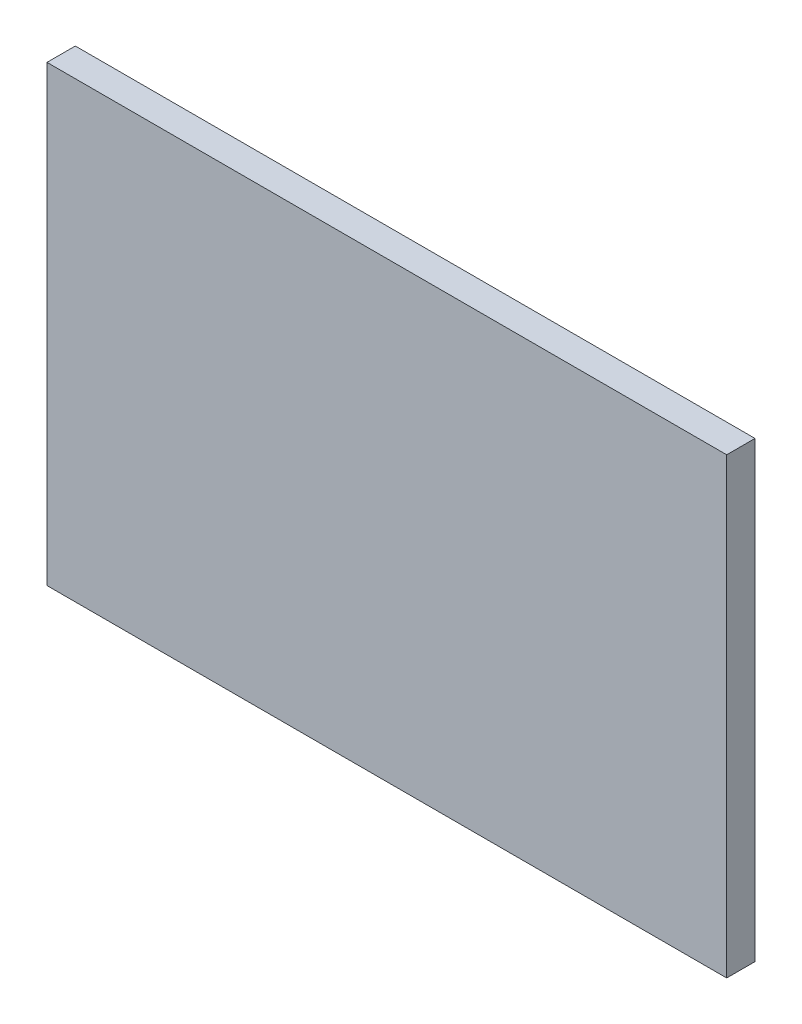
from build123d import *

# Parameters (mm, degrees)
SKETCH1_W      = 76.2
SKETCH1_H      = 50.8
EXTRUDE1_DEPTH = 3.175


with BuildPart() as part:
    # Sketch1 → Extrude1 (new body)
    with BuildSketch(Plane.XY):
        with Locations((-38.1, -25.4)):
            Rectangle(SKETCH1_W, SKETCH1_H)
    extrude(amount=EXTRUDE1_DEPTH)


solid = part.part
